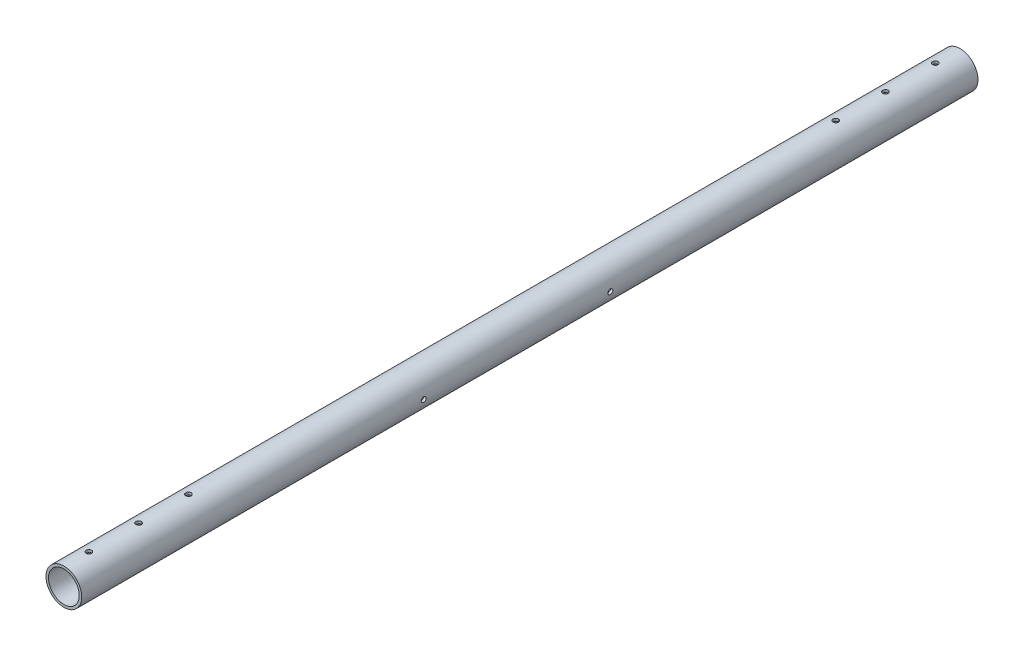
from build123d import *

# Parameters (mm, degrees)
SKETCH1_R               = 36.5125
SKETCH1_R_2             = 31.369
EXTRUDE1_DEPTH          = 914.4
SKETCH2_R               = 5.588
CUT_EXTRUDE1_DEPTH      = 919.042728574
LPATTERN1_COUNT         = 3
LPATTERN1_PITCH         = 101.6
MIRROR1_COPY_1_SKETCH_R = 5.588
MIRROR1_COPY_1_DEPTH    = 919.042728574
MIRROR1_COPY_2_SKETCH_R = 5.588
MIRROR1_COPY_2_DEPTH    = 919.042728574
SKETCH3_R               = 5.08
CUT_EXTRUDE2_DEPTH      = 919.042728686


with BuildPart() as part:
    # Sketch1 → Extrude1 (new, symmetric)
    with BuildSketch(Plane.XY):
        Circle(SKETCH1_R)
        Circle(SKETCH1_R_2, mode=Mode.SUBTRACT)
    extrude(amount=EXTRUDE1_DEPTH, both=True)

    # Sketch2 → Cut-Extrude1 (cut, through all)
    with BuildSketch(Plane(origin=(0, 36.576, 0), x_dir=(-1, 0, 0), z_dir=(0, 1, 0))):
        with Locations(Location((0, 863.6, 0), (0, 0, 90))):
            Circle(SKETCH2_R)
    cut_extrude1 = extrude(amount=-CUT_EXTRUDE1_DEPTH, mode=Mode.SUBTRACT)

    # LPattern1: Cut-Extrude1 ×3
    with Locations(*[(0, 0, -i * LPATTERN1_PITCH) for i in range(1, LPATTERN1_COUNT)]):
        add(cut_extrude1, mode=Mode.SUBTRACT)

    # Mirror1: Cut-Extrude1 across plane
    add(cut_extrude1.mirror(Plane.XY), mode=Mode.SUBTRACT)

    # Mirror1 copy 1 sketch → Mirror1 copy 1 (cut, through all)
    with BuildSketch(Plane(origin=(0, 36.576, 101.6), x_dir=(-1, 0, 0), z_dir=(0, 1, 0))):
        with Locations((0, -863.6)):
            Circle(MIRROR1_COPY_1_SKETCH_R)
    extrude(amount=-MIRROR1_COPY_1_DEPTH, mode=Mode.SUBTRACT)

    # Mirror1 copy 2 sketch → Mirror1 copy 2 (cut, through all)
    with BuildSketch(Plane(origin=(0, 36.576, 203.2), x_dir=(-1, 0, 0), z_dir=(0, 1, 0))):
        with Locations((0, -863.6)):
            Circle(MIRROR1_COPY_2_SKETCH_R)
    extrude(amount=-MIRROR1_COPY_2_DEPTH, mode=Mode.SUBTRACT)

    # Sketch3 → Cut-Extrude2 (cut, through all)
    with BuildSketch(Plane(origin=(36.576, 0, 0), x_dir=(0, 0, -1), z_dir=(1, 0, 0))):
        with Locations((-216.662, 0)):
            Circle(SKETCH3_R)
        with Locations((164.338, 0)):
            Circle(SKETCH3_R)
    extrude(amount=-CUT_EXTRUDE2_DEPTH, mode=Mode.SUBTRACT)


solid = part.part
